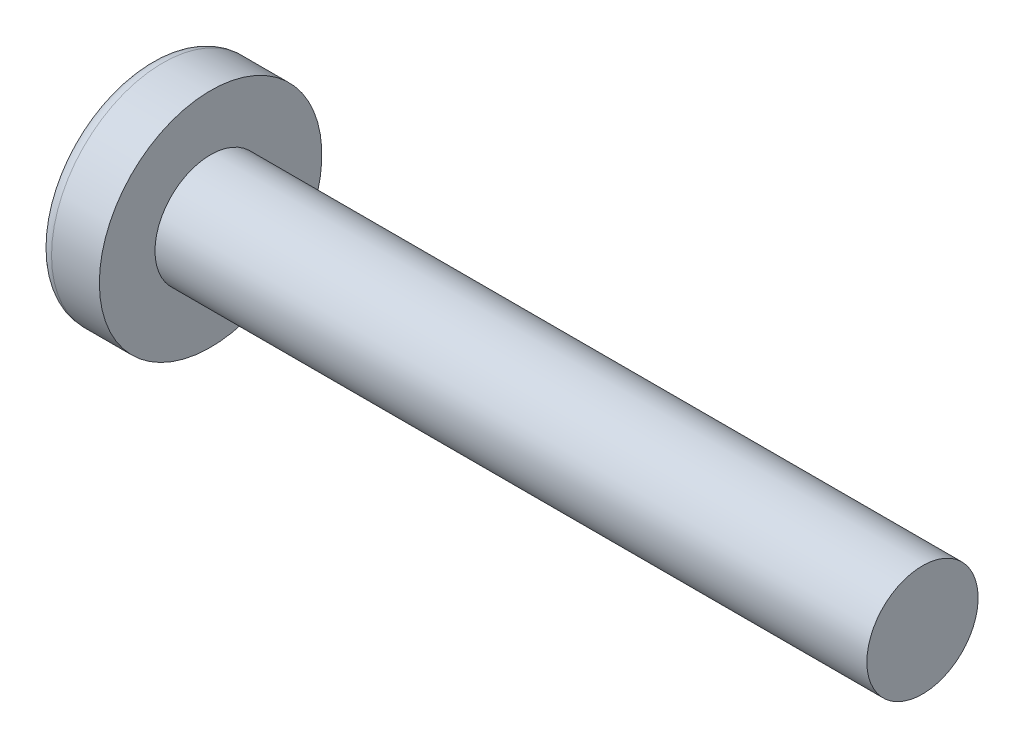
ISO-10303-21;
HEADER;
FILE_DESCRIPTION(('STEP AP214'),'2;1');
FILE_NAME('part.step','',(''),(''),'','','');
FILE_SCHEMA(('AUTOMOTIVE_DESIGN { 1 0 10303 214 1 1 1 1 }'));
ENDSEC;
DATA;
#1=APPLICATION_CONTEXT('core data for automotive mechanical design processes');
#2=APPLICATION_PROTOCOL_DEFINITION('international standard','automotive_design',2000,#1);
#3=PRODUCT_CONTEXT('',#1,'mechanical');
#4=PRODUCT('Part','Part','',(#3));
#5=PRODUCT_RELATED_PRODUCT_CATEGORY('part','',(#4));
#6=PRODUCT_DEFINITION_FORMATION('','',#4);
#7=PRODUCT_DEFINITION_CONTEXT('part definition',#1,'design');
#8=PRODUCT_DEFINITION('design','',#6,#7);
#9=PRODUCT_DEFINITION_SHAPE('','',#8);
#10=(LENGTH_UNIT() NAMED_UNIT(*) SI_UNIT(.MILLI.,.METRE.));
#11=(NAMED_UNIT(*) PLANE_ANGLE_UNIT() SI_UNIT($,.RADIAN.));
#12=(NAMED_UNIT(*) SI_UNIT($,.STERADIAN.) SOLID_ANGLE_UNIT());
#13=UNCERTAINTY_MEASURE_WITH_UNIT(LENGTH_MEASURE(1.E-05),#10,'distance_accuracy_value','');
#14=(GEOMETRIC_REPRESENTATION_CONTEXT(3) GLOBAL_UNCERTAINTY_ASSIGNED_CONTEXT((#13)) GLOBAL_UNIT_ASSIGNED_CONTEXT((#10,
#11,#12)) REPRESENTATION_CONTEXT('',''));
#15=CARTESIAN_POINT('',(0.,0.,0.));
#16=DIRECTION('',(0.,0.,1.));
#17=DIRECTION('',(1.,0.,0.));
#18=AXIS2_PLACEMENT_3D('',#15,#16,#17);
#19=CARTESIAN_POINT('',(4.,0.,0.));
#20=DIRECTION('',(-1.,0.,0.));
#21=DIRECTION('',(0.,1.,0.));
#22=AXIS2_PLACEMENT_3D('',#19,#20,#21);
#23=SPHERICAL_SURFACE('',#22,4.);
#24=CARTESIAN_POINT('',(0.783897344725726,0.,0.));
#25=DIRECTION('',(-1.,0.,0.));
#26=DIRECTION('',(0.,0.,1.));
#27=AXIS2_PLACEMENT_3D('',#24,#25,#26);
#28=CIRCLE('',#27,2.37837837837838);
#29=CARTESIAN_POINT('',(0.783897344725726,0.,2.37837837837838));
#30=VERTEX_POINT('',#29);
#31=EDGE_CURVE('E150',#30,#30,#28,.T.);
#32=ORIENTED_EDGE('',*,*,#31,.T.);
#33=EDGE_LOOP('',(#32));
#34=FACE_BOUND('',#33,.T.);
#35=CARTESIAN_POINT('',(3.98786118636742,-0.106127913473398,0.));
#36=DIRECTION('',(-0.11363816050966,-0.993522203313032,0.));
#37=DIRECTION('',(0.993522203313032,-0.11363816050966,0.));
#38=AXIS2_PLACEMENT_3D('',#35,#36,#37);
#39=CIRCLE('',#38,3.99857343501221);
#40=CARTESIAN_POINT('',(0.195539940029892,0.327634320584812,1.19110847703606));
#41=VERTEX_POINT('',#40);
#42=CARTESIAN_POINT('',(0.0301382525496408,0.346552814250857,0.346552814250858));
#43=VERTEX_POINT('',#42);
#44=EDGE_CURVE('E181',#41,#43,#39,.T.);
#45=ORIENTED_EDGE('',*,*,#44,.F.);
#46=CARTESIAN_POINT('',(3.17784904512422,0.,-1.07973473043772));
#47=DIRECTION('',(0.605808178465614,0.,0.795610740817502));
#48=DIRECTION('',(0.795610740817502,0.,-0.605808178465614));
#49=AXIS2_PLACEMENT_3D('',#46,#47,#48);
#50=CIRCLE('',#49,3.76274377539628);
#51=CARTESIAN_POINT('',(0.195539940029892,-0.327634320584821,1.19110847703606));
#52=VERTEX_POINT('',#51);
#53=EDGE_CURVE('E146',#41,#52,#50,.T.);
#54=ORIENTED_EDGE('',*,*,#53,.T.);
#55=CARTESIAN_POINT('',(3.98786118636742,0.106127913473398,0.));
#56=DIRECTION('',(-0.11363816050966,0.993522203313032,0.));
#57=DIRECTION('',(-0.993522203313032,-0.11363816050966,0.));
#58=AXIS2_PLACEMENT_3D('',#55,#56,#57);
#59=CIRCLE('',#58,3.99857343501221);
#60=CARTESIAN_POINT('',(0.0301382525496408,-0.346552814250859,0.346552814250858));
#61=VERTEX_POINT('',#60);
#62=EDGE_CURVE('E102',#61,#52,#59,.T.);
#63=ORIENTED_EDGE('',*,*,#62,.F.);
#64=CARTESIAN_POINT('',(3.98786118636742,0.,-0.106127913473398));
#65=DIRECTION('',(-0.11363816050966,0.,-0.993522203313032));
#66=DIRECTION('',(-0.993522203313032,0.,0.11363816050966));
#67=AXIS2_PLACEMENT_3D('',#64,#65,#66);
#68=CIRCLE('',#67,3.99857343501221);
#69=CARTESIAN_POINT('',(0.195539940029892,-1.19110847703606,0.327634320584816));
#70=VERTEX_POINT('',#69);
#71=EDGE_CURVE('E127',#70,#61,#68,.T.);
#72=ORIENTED_EDGE('',*,*,#71,.F.);
#73=CARTESIAN_POINT('',(3.17784904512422,1.07973473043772,0.));
#74=DIRECTION('',(0.605808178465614,-0.795610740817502,0.));
#75=DIRECTION('',(0.795610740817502,0.605808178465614,0.));
#76=AXIS2_PLACEMENT_3D('',#73,#74,#75);
#77=CIRCLE('',#76,3.76274377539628);
#78=CARTESIAN_POINT('',(0.195539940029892,-1.19110847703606,-0.327634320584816));
#79=VERTEX_POINT('',#78);
#80=EDGE_CURVE('E135',#70,#79,#77,.T.);
#81=ORIENTED_EDGE('',*,*,#80,.T.);
#82=CARTESIAN_POINT('',(3.98786118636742,0.,0.106127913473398));
#83=DIRECTION('',(-0.11363816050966,0.,0.993522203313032));
#84=DIRECTION('',(0.993522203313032,0.,0.11363816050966));
#85=AXIS2_PLACEMENT_3D('',#82,#83,#84);
#86=CIRCLE('',#85,3.99857343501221);
#87=CARTESIAN_POINT('',(0.0301382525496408,-0.346552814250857,-0.346552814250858));
#88=VERTEX_POINT('',#87);
#89=EDGE_CURVE('E45',#88,#79,#86,.T.);
#90=ORIENTED_EDGE('',*,*,#89,.F.);
#91=CARTESIAN_POINT('',(0.195539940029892,-0.327634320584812,-1.19110847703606));
#92=VERTEX_POINT('',#91);
#93=EDGE_CURVE('E188',#92,#88,#59,.T.);
#94=ORIENTED_EDGE('',*,*,#93,.F.);
#95=CARTESIAN_POINT('',(3.17784904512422,0.,1.07973473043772));
#96=DIRECTION('',(0.605808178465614,0.,-0.795610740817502));
#97=DIRECTION('',(-0.795610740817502,0.,-0.605808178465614));
#98=AXIS2_PLACEMENT_3D('',#95,#96,#97);
#99=CIRCLE('',#98,3.76274377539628);
#100=CARTESIAN_POINT('',(0.195539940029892,0.32763432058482,-1.19110847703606));
#101=VERTEX_POINT('',#100);
#102=EDGE_CURVE('E128',#92,#101,#99,.T.);
#103=ORIENTED_EDGE('',*,*,#102,.T.);
#104=CARTESIAN_POINT('',(0.0301382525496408,0.346552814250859,-0.346552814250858));
#105=VERTEX_POINT('',#104);
#106=EDGE_CURVE('E176',#105,#101,#39,.T.);
#107=ORIENTED_EDGE('',*,*,#106,.F.);
#108=CARTESIAN_POINT('',(0.195539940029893,1.19110847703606,-0.327634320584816));
#109=VERTEX_POINT('',#108);
#110=EDGE_CURVE('E38',#109,#105,#86,.T.);
#111=ORIENTED_EDGE('',*,*,#110,.F.);
#112=CARTESIAN_POINT('',(3.17784904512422,-1.07973473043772,0.));
#113=DIRECTION('',(0.605808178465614,0.795610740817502,0.));
#114=DIRECTION('',(-0.795610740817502,0.605808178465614,0.));
#115=AXIS2_PLACEMENT_3D('',#112,#113,#114);
#116=CIRCLE('',#115,3.76274377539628);
#117=CARTESIAN_POINT('',(0.195539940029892,1.19110847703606,0.327634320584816));
#118=VERTEX_POINT('',#117);
#119=EDGE_CURVE('E11',#109,#118,#116,.T.);
#120=ORIENTED_EDGE('',*,*,#119,.T.);
#121=EDGE_CURVE('E164',#43,#118,#68,.T.);
#122=ORIENTED_EDGE('',*,*,#121,.F.);
#123=EDGE_LOOP('',(#45,#54,#63,#72,#81,#90,#94,#103,#107,#111,#120,#122));
#124=FACE_BOUND('',#123,.T.);
#125=ADVANCED_FACE('F30',(#34,#124),#23,.T.);
#126=CARTESIAN_POINT('',(1.75982832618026,0.,-0.148712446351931));
#127=DIRECTION('',(-0.11363816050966,0.,0.993522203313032));
#128=DIRECTION('',(0.993522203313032,0.,0.11363816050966));
#129=AXIS2_PLACEMENT_3D('',#126,#127,#128);
#130=PLANE('',#129);
#131=ORIENTED_EDGE('',*,*,#110,.T.);
#132=DIRECTION('',(0.987168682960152,-0.112911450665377,0.112911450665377));
#133=VECTOR('',#132,1.);
#134=CARTESIAN_POINT('',(1.77640420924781,0.14681651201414,-0.146816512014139));
#135=LINE('',#134,#133);
#136=CARTESIAN_POINT('',(1.53,0.175000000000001,-0.174999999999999));
#137=VERTEX_POINT('',#136);
#138=EDGE_CURVE('E170',#105,#137,#135,.T.);
#139=ORIENTED_EDGE('',*,*,#138,.T.);
#140=DIRECTION('',(0.792336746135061,-0.603315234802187,0.0906267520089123));
#141=VECTOR('',#140,1.);
#142=CARTESIAN_POINT('',(0.,1.34,-0.35));
#143=LINE('',#142,#141);
#144=EDGE_CURVE('E151',#109,#137,#143,.T.);
#145=ORIENTED_EDGE('',*,*,#144,.F.);
#146=EDGE_LOOP('',(#131,#139,#145));
#147=FACE_BOUND('',#146,.T.);
#148=ADVANCED_FACE('F169',(#147),#130,.T.);
#149=DIRECTION('',(0.792336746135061,0.603315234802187,0.0906267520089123));
#150=VECTOR('',#149,1.);
#151=CARTESIAN_POINT('',(0.,-1.34,-0.35));
#152=LINE('',#151,#150);
#153=CARTESIAN_POINT('',(1.53,-0.175,-0.175));
#154=VERTEX_POINT('',#153);
#155=EDGE_CURVE('E136',#79,#154,#152,.T.);
#156=ORIENTED_EDGE('',*,*,#155,.T.);
#157=DIRECTION('',(-0.987168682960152,-0.112911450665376,-0.112911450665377));
#158=VECTOR('',#157,1.);
#159=CARTESIAN_POINT('',(1.77640420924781,-0.146816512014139,-0.146816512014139));
#160=LINE('',#159,#158);
#161=EDGE_CURVE('E191',#154,#88,#160,.T.);
#162=ORIENTED_EDGE('',*,*,#161,.T.);
#163=ORIENTED_EDGE('',*,*,#89,.T.);
#164=EDGE_LOOP('',(#156,#162,#163));
#165=FACE_BOUND('',#164,.T.);
#166=ADVANCED_FACE('F206',(#165),#130,.T.);
#167=CARTESIAN_POINT('',(1.75982832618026,0.,0.148712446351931));
#168=DIRECTION('',(-0.11363816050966,0.,-0.993522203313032));
#169=DIRECTION('',(-0.993522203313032,0.,0.11363816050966));
#170=AXIS2_PLACEMENT_3D('',#167,#168,#169);
#171=PLANE('',#170);
#172=DIRECTION('',(0.792336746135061,-0.603315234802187,-0.0906267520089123));
#173=VECTOR('',#172,1.);
#174=CARTESIAN_POINT('',(0.,1.34,0.35));
#175=LINE('',#174,#173);
#176=CARTESIAN_POINT('',(1.53,0.175,0.175));
#177=VERTEX_POINT('',#176);
#178=EDGE_CURVE('E207',#118,#177,#175,.T.);
#179=ORIENTED_EDGE('',*,*,#178,.T.);
#180=DIRECTION('',(-0.987168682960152,0.112911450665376,0.112911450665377));
#181=VECTOR('',#180,1.);
#182=CARTESIAN_POINT('',(1.77640420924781,0.146816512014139,0.146816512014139));
#183=LINE('',#182,#181);
#184=EDGE_CURVE('E185',#177,#43,#183,.T.);
#185=ORIENTED_EDGE('',*,*,#184,.T.);
#186=ORIENTED_EDGE('',*,*,#121,.T.);
#187=EDGE_LOOP('',(#179,#185,#186));
#188=FACE_BOUND('',#187,.T.);
#189=ADVANCED_FACE('F211',(#188),#171,.T.);
#190=ORIENTED_EDGE('',*,*,#71,.T.);
#191=DIRECTION('',(0.987168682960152,0.112911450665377,-0.112911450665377));
#192=VECTOR('',#191,1.);
#193=CARTESIAN_POINT('',(1.77640420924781,-0.14681651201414,0.146816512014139));
#194=LINE('',#193,#192);
#195=CARTESIAN_POINT('',(1.53,-0.175000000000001,0.174999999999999));
#196=VERTEX_POINT('',#195);
#197=EDGE_CURVE('E100',#61,#196,#194,.T.);
#198=ORIENTED_EDGE('',*,*,#197,.T.);
#199=DIRECTION('',(0.792336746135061,0.603315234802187,-0.0906267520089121));
#200=VECTOR('',#199,1.);
#201=CARTESIAN_POINT('',(0.,-1.34,0.35));
#202=LINE('',#201,#200);
#203=EDGE_CURVE('E125',#70,#196,#202,.T.);
#204=ORIENTED_EDGE('',*,*,#203,.F.);
#205=EDGE_LOOP('',(#190,#198,#204));
#206=FACE_BOUND('',#205,.T.);
#207=ADVANCED_FACE('F124',(#206),#171,.T.);
#208=CARTESIAN_POINT('',(-25.4,0.,0.));
#209=DIRECTION('',(-1.,0.,0.));
#210=DIRECTION('',(0.,0.,1.));
#211=AXIS2_PLACEMENT_3D('',#208,#209,#210);
#212=CYLINDRICAL_SURFACE('',#211,1.25);
#213=CARTESIAN_POINT('',(18.1,0.,0.));
#214=DIRECTION('',(-1.,0.,0.));
#215=DIRECTION('',(0.,0.,1.));
#216=AXIS2_PLACEMENT_3D('',#213,#214,#215);
#217=CIRCLE('',#216,1.25);
#218=CARTESIAN_POINT('',(18.1,0.,1.25));
#219=VERTEX_POINT('',#218);
#220=EDGE_CURVE('E147',#219,#219,#217,.T.);
#221=ORIENTED_EDGE('',*,*,#220,.T.);
#222=EDGE_LOOP('',(#221));
#223=FACE_BOUND('',#222,.T.);
#224=CARTESIAN_POINT('',(2.1,0.,0.));
#225=DIRECTION('',(-1.,0.,0.));
#226=DIRECTION('',(0.,0.,1.));
#227=AXIS2_PLACEMENT_3D('',#224,#225,#226);
#228=CIRCLE('',#227,1.25);
#229=CARTESIAN_POINT('',(2.1,0.,1.25));
#230=VERTEX_POINT('',#229);
#231=EDGE_CURVE('E160',#230,#230,#228,.T.);
#232=ORIENTED_EDGE('',*,*,#231,.F.);
#233=EDGE_LOOP('',(#232));
#234=FACE_BOUND('',#233,.T.);
#235=ADVANCED_FACE('F32',(#223,#234),#212,.T.);
#236=CARTESIAN_POINT('',(2.1,1.25,0.));
#237=DIRECTION('',(-1.,0.,0.));
#238=DIRECTION('',(0.,0.,1.));
#239=AXIS2_PLACEMENT_3D('',#236,#237,#238);
#240=PLANE('',#239);
#241=CARTESIAN_POINT('',(2.1,0.,0.));
#242=DIRECTION('',(-1.,0.,0.));
#243=DIRECTION('',(0.,0.,1.));
#244=AXIS2_PLACEMENT_3D('',#241,#242,#243);
#245=CIRCLE('',#244,2.5);
#246=CARTESIAN_POINT('',(2.1,0.,2.5));
#247=VERTEX_POINT('',#246);
#248=EDGE_CURVE('E157',#247,#247,#245,.T.);
#249=ORIENTED_EDGE('',*,*,#248,.F.);
#250=EDGE_LOOP('',(#249));
#251=FACE_BOUND('',#250,.T.);
#252=ORIENTED_EDGE('',*,*,#231,.T.);
#253=EDGE_LOOP('',(#252));
#254=FACE_BOUND('',#253,.T.);
#255=ADVANCED_FACE('F239',(#251,#254),#240,.F.);
#256=CARTESIAN_POINT('',(-25.4,0.,0.));
#257=DIRECTION('',(-1.,0.,0.));
#258=DIRECTION('',(0.,0.,1.));
#259=AXIS2_PLACEMENT_3D('',#256,#257,#258);
#260=CYLINDRICAL_SURFACE('',#259,2.5);
#261=ORIENTED_EDGE('',*,*,#248,.T.);
#262=EDGE_LOOP('',(#261));
#263=FACE_BOUND('',#262,.T.);
#264=CARTESIAN_POINT('',(1.0251050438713,0.,0.));
#265=DIRECTION('',(-1.,0.,0.));
#266=DIRECTION('',(0.,0.,1.));
#267=AXIS2_PLACEMENT_3D('',#264,#265,#266);
#268=CIRCLE('',#267,2.5);
#269=CARTESIAN_POINT('',(1.0251050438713,0.,2.5));
#270=VERTEX_POINT('',#269);
#271=EDGE_CURVE('E154',#270,#270,#268,.T.);
#272=ORIENTED_EDGE('',*,*,#271,.F.);
#273=EDGE_LOOP('',(#272));
#274=FACE_BOUND('',#273,.T.);
#275=ADVANCED_FACE('F236',(#263,#274),#260,.T.);
#276=CARTESIAN_POINT('',(1.0251050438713,0.,0.));
#277=DIRECTION('',(-1.,0.,0.));
#278=DIRECTION('',(0.,0.,1.));
#279=AXIS2_PLACEMENT_3D('',#276,#277,#278);
#280=TOROIDAL_SURFACE('',#279,2.2,0.3);
#281=ORIENTED_EDGE('',*,*,#271,.T.);
#282=EDGE_LOOP('',(#281));
#283=FACE_BOUND('',#282,.T.);
#284=ORIENTED_EDGE('',*,*,#31,.F.);
#285=EDGE_LOOP('',(#284));
#286=FACE_BOUND('',#285,.T.);
#287=ADVANCED_FACE('F233',(#283,#286),#280,.T.);
#288=CARTESIAN_POINT('',(18.1,1.25,0.));
#289=DIRECTION('',(1.,0.,0.));
#290=DIRECTION('',(0.,0.,-1.));
#291=AXIS2_PLACEMENT_3D('',#288,#289,#290);
#292=PLANE('',#291);
#293=ORIENTED_EDGE('',*,*,#220,.F.);
#294=EDGE_LOOP('',(#293));
#295=FACE_BOUND('',#294,.T.);
#296=ADVANCED_FACE('F231',(#295),#292,.T.);
#297=CARTESIAN_POINT('',(1.53,0.175,0.175));
#298=DIRECTION('',(0.605808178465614,0.795610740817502,0.));
#299=DIRECTION('',(-0.795610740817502,0.605808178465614,0.));
#300=AXIS2_PLACEMENT_3D('',#297,#298,#299);
#301=PLANE('',#300);
#302=ORIENTED_EDGE('',*,*,#144,.T.);
#303=DIRECTION('',(0.,0.,-1.));
#304=VECTOR('',#303,1.);
#305=CARTESIAN_POINT('',(1.53,0.175,0.175));
#306=LINE('',#305,#304);
#307=EDGE_CURVE('E118',#177,#137,#306,.T.);
#308=ORIENTED_EDGE('',*,*,#307,.F.);
#309=ORIENTED_EDGE('',*,*,#178,.F.);
#310=ORIENTED_EDGE('',*,*,#119,.F.);
#311=EDGE_LOOP('',(#302,#308,#309,#310));
#312=FACE_BOUND('',#311,.T.);
#313=ADVANCED_FACE('F210',(#312),#301,.F.);
#314=CARTESIAN_POINT('',(1.53,-0.175,-0.175));
#315=DIRECTION('',(0.605808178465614,-0.795610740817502,0.));
#316=DIRECTION('',(0.795610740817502,0.605808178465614,0.));
#317=AXIS2_PLACEMENT_3D('',#314,#315,#316);
#318=PLANE('',#317);
#319=ORIENTED_EDGE('',*,*,#203,.T.);
#320=DIRECTION('',(0.,0.,1.));
#321=VECTOR('',#320,1.);
#322=CARTESIAN_POINT('',(1.53,-0.175,-0.175));
#323=LINE('',#322,#321);
#324=EDGE_CURVE('E117',#154,#196,#323,.T.);
#325=ORIENTED_EDGE('',*,*,#324,.F.);
#326=ORIENTED_EDGE('',*,*,#155,.F.);
#327=ORIENTED_EDGE('',*,*,#80,.F.);
#328=EDGE_LOOP('',(#319,#325,#326,#327));
#329=FACE_BOUND('',#328,.T.);
#330=ADVANCED_FACE('F132',(#329),#318,.F.);
#331=CARTESIAN_POINT('',(1.53,0.175,-0.175));
#332=DIRECTION('',(-1.,0.,0.));
#333=DIRECTION('',(0.,0.,1.));
#334=AXIS2_PLACEMENT_3D('',#331,#332,#333);
#335=PLANE('',#334);
#336=DIRECTION('',(0.,1.,0.));
#337=VECTOR('',#336,1.);
#338=CARTESIAN_POINT('',(1.53,-0.175,-0.175));
#339=LINE('',#338,#337);
#340=EDGE_CURVE('E140',#154,#137,#339,.T.);
#341=ORIENTED_EDGE('',*,*,#340,.F.);
#342=ORIENTED_EDGE('',*,*,#324,.T.);
#343=DIRECTION('',(0.,-1.,0.));
#344=VECTOR('',#343,1.);
#345=CARTESIAN_POINT('',(1.53,0.175,0.175));
#346=LINE('',#345,#344);
#347=EDGE_CURVE('E109',#177,#196,#346,.T.);
#348=ORIENTED_EDGE('',*,*,#347,.F.);
#349=ORIENTED_EDGE('',*,*,#307,.T.);
#350=EDGE_LOOP('',(#341,#342,#348,#349));
#351=FACE_BOUND('',#350,.T.);
#352=ADVANCED_FACE('F138',(#351),#335,.T.);
#353=CARTESIAN_POINT('',(1.53,0.175000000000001,-0.174999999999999));
#354=DIRECTION('',(0.605808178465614,0.,-0.795610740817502));
#355=DIRECTION('',(0.795610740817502,0.,0.605808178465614));
#356=AXIS2_PLACEMENT_3D('',#353,#354,#355);
#357=PLANE('',#356);
#358=DIRECTION('',(0.792336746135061,0.09062675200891,0.603315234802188));
#359=VECTOR('',#358,1.);
#360=CARTESIAN_POINT('',(0.,-0.349999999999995,-1.34));
#361=LINE('',#360,#359);
#362=EDGE_CURVE('E196',#92,#154,#361,.T.);
#363=ORIENTED_EDGE('',*,*,#362,.T.);
#364=ORIENTED_EDGE('',*,*,#340,.T.);
#365=DIRECTION('',(0.792336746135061,-0.0906267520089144,0.603315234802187));
#366=VECTOR('',#365,1.);
#367=CARTESIAN_POINT('',(0.,0.350000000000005,-1.34));
#368=LINE('',#367,#366);
#369=EDGE_CURVE('E106',#101,#137,#368,.T.);
#370=ORIENTED_EDGE('',*,*,#369,.F.);
#371=ORIENTED_EDGE('',*,*,#102,.F.);
#372=EDGE_LOOP('',(#363,#364,#370,#371));
#373=FACE_BOUND('',#372,.T.);
#374=ADVANCED_FACE('F201',(#373),#357,.F.);
#375=CARTESIAN_POINT('',(1.75982832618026,-0.148712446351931,0.));
#376=DIRECTION('',(-0.11363816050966,0.993522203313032,0.));
#377=DIRECTION('',(-0.993522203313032,-0.11363816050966,0.));
#378=AXIS2_PLACEMENT_3D('',#375,#376,#377);
#379=PLANE('',#378);
#380=ORIENTED_EDGE('',*,*,#93,.T.);
#381=ORIENTED_EDGE('',*,*,#161,.F.);
#382=ORIENTED_EDGE('',*,*,#362,.F.);
#383=EDGE_LOOP('',(#380,#381,#382));
#384=FACE_BOUND('',#383,.T.);
#385=ADVANCED_FACE('F205',(#384),#379,.T.);
#386=CARTESIAN_POINT('',(1.75982832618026,0.148712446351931,0.));
#387=DIRECTION('',(-0.11363816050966,-0.993522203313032,0.));
#388=DIRECTION('',(0.993522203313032,-0.11363816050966,0.));
#389=AXIS2_PLACEMENT_3D('',#386,#387,#388);
#390=PLANE('',#389);
#391=ORIENTED_EDGE('',*,*,#106,.T.);
#392=ORIENTED_EDGE('',*,*,#369,.T.);
#393=ORIENTED_EDGE('',*,*,#138,.F.);
#394=EDGE_LOOP('',(#391,#392,#393));
#395=FACE_BOUND('',#394,.T.);
#396=ADVANCED_FACE('F199',(#395),#390,.T.);
#397=CARTESIAN_POINT('',(1.53,-0.175000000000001,0.174999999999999));
#398=DIRECTION('',(0.605808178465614,0.,0.795610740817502));
#399=DIRECTION('',(-0.795610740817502,0.,0.605808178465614));
#400=AXIS2_PLACEMENT_3D('',#397,#398,#399);
#401=PLANE('',#400);
#402=DIRECTION('',(0.792336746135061,-0.0906267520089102,-0.603315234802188));
#403=VECTOR('',#402,1.);
#404=CARTESIAN_POINT('',(0.,0.349999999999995,1.34));
#405=LINE('',#404,#403);
#406=EDGE_CURVE('E105',#41,#177,#405,.T.);
#407=ORIENTED_EDGE('',*,*,#406,.T.);
#408=ORIENTED_EDGE('',*,*,#347,.T.);
#409=DIRECTION('',(0.792336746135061,0.0906267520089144,-0.603315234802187));
#410=VECTOR('',#409,1.);
#411=CARTESIAN_POINT('',(0.,-0.350000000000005,1.34));
#412=LINE('',#411,#410);
#413=EDGE_CURVE('E96',#52,#196,#412,.T.);
#414=ORIENTED_EDGE('',*,*,#413,.F.);
#415=ORIENTED_EDGE('',*,*,#53,.F.);
#416=EDGE_LOOP('',(#407,#408,#414,#415));
#417=FACE_BOUND('',#416,.T.);
#418=ADVANCED_FACE('F110',(#417),#401,.F.);
#419=ORIENTED_EDGE('',*,*,#44,.T.);
#420=ORIENTED_EDGE('',*,*,#184,.F.);
#421=ORIENTED_EDGE('',*,*,#406,.F.);
#422=EDGE_LOOP('',(#419,#420,#421));
#423=FACE_BOUND('',#422,.T.);
#424=ADVANCED_FACE('F212',(#423),#390,.T.);
#425=ORIENTED_EDGE('',*,*,#62,.T.);
#426=ORIENTED_EDGE('',*,*,#413,.T.);
#427=ORIENTED_EDGE('',*,*,#197,.F.);
#428=EDGE_LOOP('',(#425,#426,#427));
#429=FACE_BOUND('',#428,.T.);
#430=ADVANCED_FACE('F98',(#429),#379,.T.);
#431=CLOSED_SHELL('',(#125,#148,#166,#189,#207,#235,#255,#275,#287,#296,#313,#330,#352,#374,
#385,#396,#418,#424,#430));
#432=MANIFOLD_SOLID_BREP('B2',#431);
#433=ADVANCED_BREP_SHAPE_REPRESENTATION('',(#18,#432),#14);
#434=SHAPE_DEFINITION_REPRESENTATION(#9,#433);
ENDSEC;
END-ISO-10303-21;
